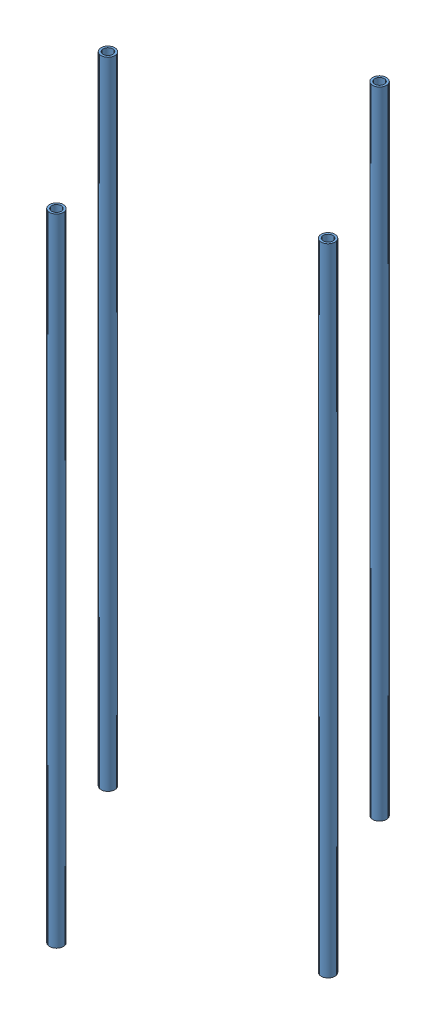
SolidWorks assembly Assem6.SLDASM, configuration Default (file format 14000). Lengths in mm.
Overall size (77.14 141.5 77.14).
12 component instances, 5 part files, 14 mates.
Components (placement in the parent):
- base-1: base.SLDPRT [Default] at (66.7542 -25.1025 121.7336) x (0.982502 0 0.186254) z (-0.186254 0 0.982502) size (66 10 66)
- base1-1: base1.SLDPRT [Default] at (66.7542 0.2438 121.7336) x (0.982502 0 0.186254) z (-0.186254 0 0.982502) size (60 2.5 60)
- body-1: body.SLDPRT [Default] at (66.7542 -20.1025 121.7336) size (66 100 66)
- pin-1: pin.SLDPRT [Default] at (62.0979 -30.1025 146.2961) size (2.5 115 2.5)
- pin-2: pin.SLDPRT [Default] at (91.3168 -30.1025 126.3899) size (2.5 115 2.5)
- pin-3: pin.SLDPRT [Default] at (71.4106 -30.1025 97.171) size (2.5 115 2.5)
- pin-4: pin.SLDPRT [Default] at (42.1917 -30.1025 117.0772) size (2.5 115 2.5)
- base1-2: base1.SLDPRT [Default] at (66.7542 15.2438 121.7336) x (0.982502 0 0.186254) z (-0.186254 0 0.982502) size (60 2.5 60)
- base1-3: base1.SLDPRT [Default] at (66.7542 30.2438 121.7336) x (0.982502 0 0.186254) z (-0.186254 0 0.982502) size (60 2.5 60)
- base1-4: base1.SLDPRT [Default] at (66.7542 45.2438 121.7336) x (0.982502 0 0.186254) z (-0.186254 0 0.982502) size (60 2.5 60)
- base1-5: base1.SLDPRT [Default] at (66.7542 60.2438 121.7336) x (0.982502 0 0.186254) z (-0.186254 0 0.982502) size (60 2.5 60)
- Part17-1: Part17.SLDPRT [Default] at (66.7542 84.8975 121.7336) x (-0.186254 0 0.982502) z (0.982502 0 0.186254) size (66 36.5 66)
Mates (geometry in assembly coordinates):
- Concentric1: concentric anti-aligned: cylinder of base-1 through (42.1917 -30.1025 117.0772) axis (0 1 0) radius 1.25; cylinder of pin-4 through (42.1917 84.8975 117.0772) axis (0 -1 0) radius 1.25
- Concentric2: concentric anti-aligned: cylinder of base-1 through (71.4106 -30.1025 97.171) axis (0 1 0) radius 1.25; cylinder of pin-3 through (71.4106 84.8975 97.171) axis (0 -1 0) radius 1.25
- Concentric3: concentric anti-aligned: cylinder of base-1 through (91.3168 -30.1025 126.3899) axis (0 1 0) radius 1.25; cylinder of pin-2 through (91.3168 84.8975 126.3899) axis (0 -1 0) radius 1.25
- Concentric4: concentric anti-aligned: cylinder of base-1 through (62.0979 -30.1025 146.2961) axis (0 1 0) radius 1.25; cylinder of pin-1 through (62.0979 84.8975 146.2961) axis (0 -1 0) radius 1.25
- Concentric5: concentric aligned: cylinder of base1-1 through (71.4106 2.7438 97.171) axis (0 -1 0) radius 1.25; cylinder of pin-3 through (71.4106 84.8975 97.171) axis (0 -1 0) radius 1.25
- Concentric6: concentric aligned: cylinder of base1-1 through (42.1917 2.7438 117.0772) axis (0 -1 0) radius 1.25; cylinder of pin-4 through (42.1917 84.8975 117.0772) axis (0 -1 0) radius 1.25
- Concentric7: concentric aligned: cylinder of base1-1 through (62.0979 2.7438 146.2961) axis (0 -1 0) radius 1.25; cylinder of pin-1 through (62.0979 84.8975 146.2961) axis (0 -1 0) radius 1.25
- Concentric8: concentric aligned: cylinder of base1-1 through (91.3168 2.7438 126.3899) axis (0 -1 0) radius 1.25; cylinder of pin-2 through (91.3168 84.8975 126.3899) axis (0 -1 0) radius 1.25
- Coincident7: coincident aligned: plane of base-1 through (66.7542 -20.1025 121.7336) normal (0 1 0); circle of body-1
- Coincident8: coincident aligned: circle of base-1; circle of body-1
- Concentric9: concentric anti-aligned: cylinder of body-1 through (66.7542 79.8975 121.7336) axis (0 -1 0) radius 30.5; cylinder of Part17-1 through (66.7542 74.8975 121.7336) axis (0 1 0) radius 29.5
- Coincident9: coincident aligned: cylinder of body-1 through (66.7542 79.8975 121.7336) axis (0 -1 0) radius 33; circle of Part17-1
- Coincident10: coincident anti-aligned: plane of body-1 through (66.7542 79.8975 121.7336) normal (0 1 0); plane of Part17-1 through (66.7542 79.8975 121.7336) normal (0 -1 0)
- Concentric10: concentric anti-aligned: cylinder of pin-3 through (71.4106 84.8975 97.171) axis (0 -1 0) radius 1.25; cylinder of Part17-1 through (71.4106 74.8975 97.171) axis (0 1 0) radius 1.25
